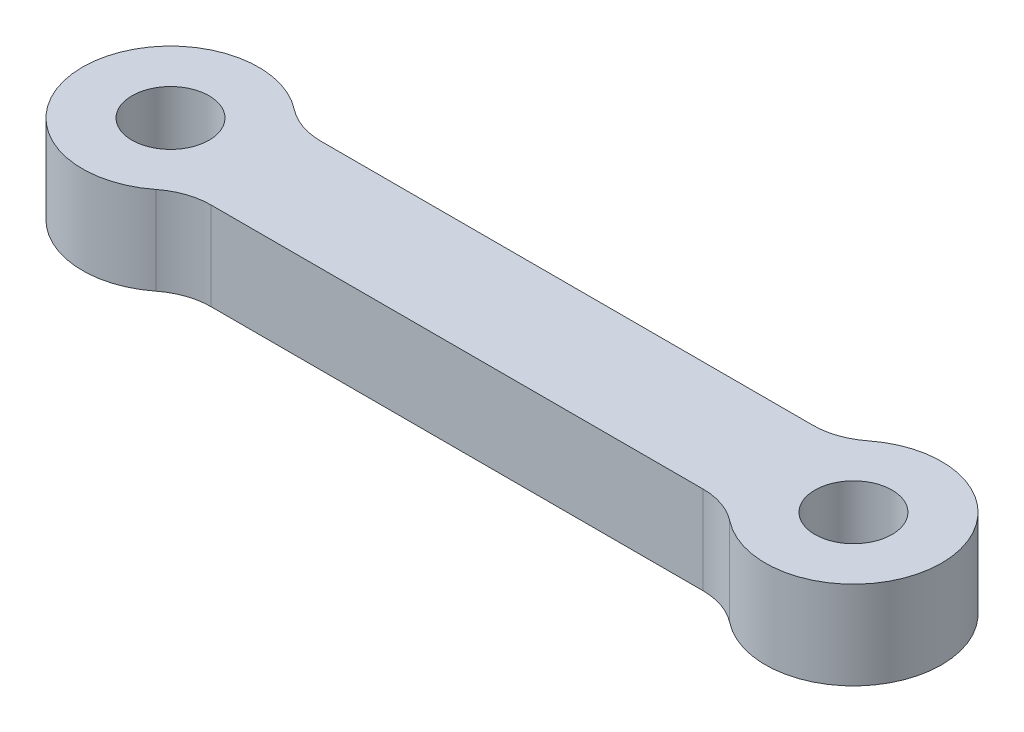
from build123d import *

# Parameters (mm, degrees)
SKETCH1_R           = 1.75
BOSS_EXTRUDE1_DEPTH = 4
FILLET1_R           = 3


with BuildPart() as part:
    # Sketch1 → Boss-Extrude1 (new body)
    with BuildSketch(Plane(origin=(0, 0, 0), x_dir=(1, 0, 0), z_dir=(0, 1, 0))):
        with BuildLine():
            ThreePointArc((3.122498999, 2.5), (-4, 0), (3.122498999, -2.5))
            Line((3.122498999, -2.5), (27.877501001, -2.5))
            ThreePointArc((27.877501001, -2.5), (35, 0), (27.877501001, 2.5))
            Line((27.877501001, 2.5), (3.122498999, 2.5))
        make_face()
        with Locations(Location((0, 0, 0), (0, 0, 270))):
            Circle(SKETCH1_R, mode=Mode.SUBTRACT)
        with Locations(Location((31, 0, 0), (0, 0, 270))):
            Circle(SKETCH1_R, mode=Mode.SUBTRACT)
    extrude(amount=BOSS_EXTRUDE1_DEPTH)

    # Fillet1
    fillet1_edges = [part.edges().sort_by_distance(p)[0] for p in [
        (27.877501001, 2, 2.5),
        (3.122498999, 2, 2.5),
        (3.122498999, 2, -2.5),
        (27.877501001, 2, -2.5),
    ]]
    fillet(fillet1_edges, radius=FILLET1_R)


solid = part.part
